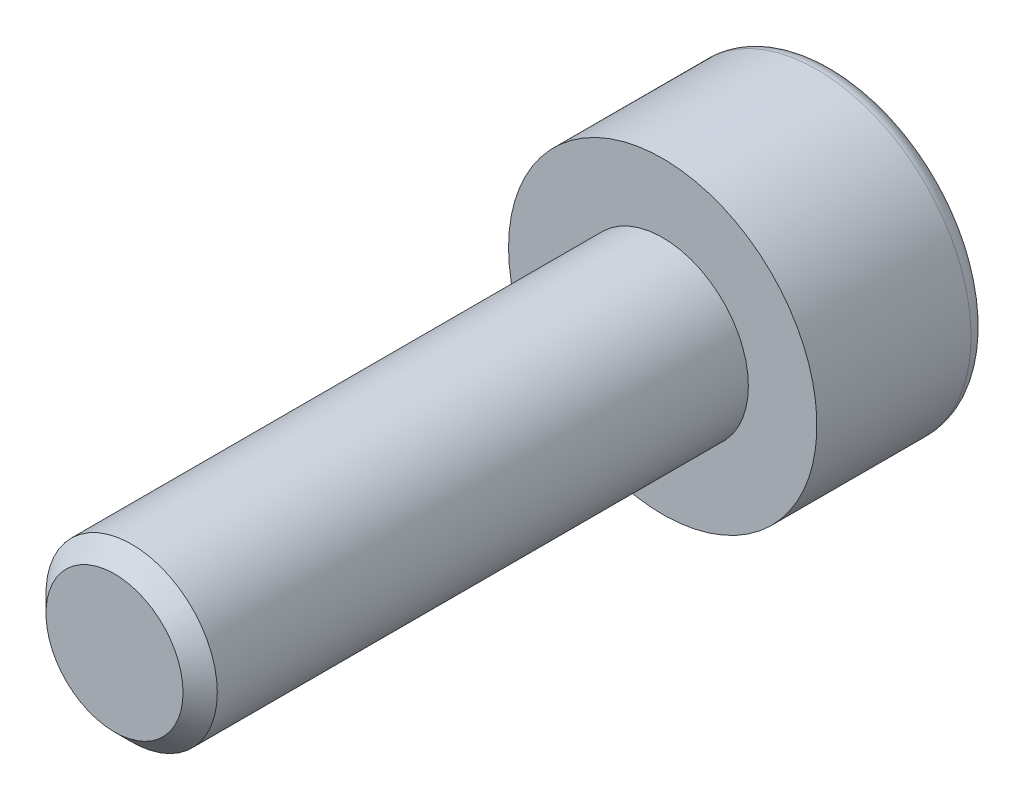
ISO-10303-21;
HEADER;
FILE_DESCRIPTION(('STEP AP214'),'2;1');
FILE_NAME('part.step','',(''),(''),'','','');
FILE_SCHEMA(('AUTOMOTIVE_DESIGN { 1 0 10303 214 1 1 1 1 }'));
ENDSEC;
DATA;
#1=APPLICATION_CONTEXT('core data for automotive mechanical design processes');
#2=APPLICATION_PROTOCOL_DEFINITION('international standard','automotive_design',2000,#1);
#3=PRODUCT_CONTEXT('',#1,'mechanical');
#4=PRODUCT('Part','Part','',(#3));
#5=PRODUCT_RELATED_PRODUCT_CATEGORY('part','',(#4));
#6=PRODUCT_DEFINITION_FORMATION('','',#4);
#7=PRODUCT_DEFINITION_CONTEXT('part definition',#1,'design');
#8=PRODUCT_DEFINITION('design','',#6,#7);
#9=PRODUCT_DEFINITION_SHAPE('','',#8);
#10=(LENGTH_UNIT() NAMED_UNIT(*) SI_UNIT(.MILLI.,.METRE.));
#11=(NAMED_UNIT(*) PLANE_ANGLE_UNIT() SI_UNIT($,.RADIAN.));
#12=(NAMED_UNIT(*) SI_UNIT($,.STERADIAN.) SOLID_ANGLE_UNIT());
#13=UNCERTAINTY_MEASURE_WITH_UNIT(LENGTH_MEASURE(1.E-05),#10,'distance_accuracy_value','');
#14=(GEOMETRIC_REPRESENTATION_CONTEXT(3) GLOBAL_UNCERTAINTY_ASSIGNED_CONTEXT((#13)) GLOBAL_UNIT_ASSIGNED_CONTEXT((#10,
#11,#12)) REPRESENTATION_CONTEXT('',''));
#15=CARTESIAN_POINT('',(0.,0.,0.));
#16=DIRECTION('',(0.,0.,1.));
#17=DIRECTION('',(1.,0.,0.));
#18=AXIS2_PLACEMENT_3D('',#15,#16,#17);
#19=CARTESIAN_POINT('',(0.,0.,-2.5));
#20=DIRECTION('',(0.,0.,1.));
#21=DIRECTION('',(1.,0.,0.));
#22=AXIS2_PLACEMENT_3D('',#19,#20,#21);
#23=PLANE('',#22);
#24=CARTESIAN_POINT('',(0.,0.,-2.5));
#25=DIRECTION('',(0.,0.,-1.));
#26=DIRECTION('',(-1.,0.,0.));
#27=AXIS2_PLACEMENT_3D('',#24,#25,#26);
#28=CIRCLE('',#27,2.);
#29=CARTESIAN_POINT('',(-2.,0.,-2.5));
#30=VERTEX_POINT('',#29);
#31=EDGE_CURVE('E138',#30,#30,#28,.T.);
#32=ORIENTED_EDGE('',*,*,#31,.T.);
#33=EDGE_LOOP('',(#32));
#34=FACE_BOUND('',#33,.T.);
#35=DIRECTION('',(-0.5,-0.866025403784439,0.));
#36=VECTOR('',#35,1.);
#37=CARTESIAN_POINT('',(-0.577350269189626,1.,-2.5));
#38=LINE('',#37,#36);
#39=CARTESIAN_POINT('',(-0.577350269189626,1.,-2.5));
#40=VERTEX_POINT('',#39);
#41=CARTESIAN_POINT('',(-1.15470053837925,0.,-2.5));
#42=VERTEX_POINT('',#41);
#43=EDGE_CURVE('E42',#40,#42,#38,.T.);
#44=ORIENTED_EDGE('',*,*,#43,.T.);
#45=DIRECTION('',(0.5,-0.866025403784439,0.));
#46=VECTOR('',#45,1.);
#47=CARTESIAN_POINT('',(-1.15470053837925,0.,-2.5));
#48=LINE('',#47,#46);
#49=CARTESIAN_POINT('',(-0.577350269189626,-0.999999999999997,-2.5));
#50=VERTEX_POINT('',#49);
#51=EDGE_CURVE('E82',#42,#50,#48,.T.);
#52=ORIENTED_EDGE('',*,*,#51,.T.);
#53=DIRECTION('',(1.,0.,0.));
#54=VECTOR('',#53,1.);
#55=CARTESIAN_POINT('',(-0.577350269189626,-0.999999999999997,-2.5));
#56=LINE('',#55,#54);
#57=CARTESIAN_POINT('',(0.577350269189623,-0.999999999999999,-2.5));
#58=VERTEX_POINT('',#57);
#59=EDGE_CURVE('E90',#50,#58,#56,.T.);
#60=ORIENTED_EDGE('',*,*,#59,.T.);
#61=DIRECTION('',(0.5,0.866025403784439,0.));
#62=VECTOR('',#61,1.);
#63=CARTESIAN_POINT('',(0.577350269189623,-0.999999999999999,-2.5));
#64=LINE('',#63,#62);
#65=CARTESIAN_POINT('',(1.15470053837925,0.,-2.5));
#66=VERTEX_POINT('',#65);
#67=EDGE_CURVE('E108',#58,#66,#64,.T.);
#68=ORIENTED_EDGE('',*,*,#67,.T.);
#69=DIRECTION('',(-0.5,0.866025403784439,0.));
#70=VECTOR('',#69,1.);
#71=CARTESIAN_POINT('',(1.15470053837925,0.,-2.5));
#72=LINE('',#71,#70);
#73=CARTESIAN_POINT('',(0.577350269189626,1.,-2.5));
#74=VERTEX_POINT('',#73);
#75=EDGE_CURVE('E111',#66,#74,#72,.T.);
#76=ORIENTED_EDGE('',*,*,#75,.T.);
#77=DIRECTION('',(-1.,0.,0.));
#78=VECTOR('',#77,1.);
#79=CARTESIAN_POINT('',(0.577350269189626,1.,-2.5));
#80=LINE('',#79,#78);
#81=EDGE_CURVE('E101',#74,#40,#80,.T.);
#82=ORIENTED_EDGE('',*,*,#81,.T.);
#83=EDGE_LOOP('',(#44,#52,#60,#68,#76,#82));
#84=FACE_BOUND('',#83,.T.);
#85=ADVANCED_FACE('F28',(#34,#84),#23,.F.);
#86=CARTESIAN_POINT('',(0.,0.,-2.25));
#87=DIRECTION('',(0.,0.,-1.));
#88=DIRECTION('',(-1.,0.,0.));
#89=AXIS2_PLACEMENT_3D('',#86,#87,#88);
#90=TOROIDAL_SURFACE('',#89,2.,0.25);
#91=ORIENTED_EDGE('',*,*,#31,.F.);
#92=EDGE_LOOP('',(#91));
#93=FACE_BOUND('',#92,.T.);
#94=CARTESIAN_POINT('',(0.,0.,-2.25));
#95=DIRECTION('',(0.,0.,-1.));
#96=DIRECTION('',(-1.,0.,0.));
#97=AXIS2_PLACEMENT_3D('',#94,#95,#96);
#98=CIRCLE('',#97,2.25);
#99=CARTESIAN_POINT('',(-2.25,0.,-2.25));
#100=VERTEX_POINT('',#99);
#101=EDGE_CURVE('E135',#100,#100,#98,.T.);
#102=ORIENTED_EDGE('',*,*,#101,.T.);
#103=EDGE_LOOP('',(#102));
#104=FACE_BOUND('',#103,.T.);
#105=ADVANCED_FACE('F157',(#93,#104),#90,.T.);
#106=CARTESIAN_POINT('',(0.,0.,0.));
#107=DIRECTION('',(0.,0.,-1.));
#108=DIRECTION('',(-1.,0.,0.));
#109=AXIS2_PLACEMENT_3D('',#106,#107,#108);
#110=CYLINDRICAL_SURFACE('',#109,2.25);
#111=ORIENTED_EDGE('',*,*,#101,.F.);
#112=EDGE_LOOP('',(#111));
#113=FACE_BOUND('',#112,.T.);
#114=CARTESIAN_POINT('',(0.,0.,0.));
#115=DIRECTION('',(0.,0.,-1.));
#116=DIRECTION('',(-1.,0.,0.));
#117=AXIS2_PLACEMENT_3D('',#114,#115,#116);
#118=CIRCLE('',#117,2.25);
#119=CARTESIAN_POINT('',(-2.25,0.,0.));
#120=VERTEX_POINT('',#119);
#121=EDGE_CURVE('E96',#120,#120,#118,.T.);
#122=ORIENTED_EDGE('',*,*,#121,.T.);
#123=EDGE_LOOP('',(#122));
#124=FACE_BOUND('',#123,.T.);
#125=ADVANCED_FACE('F162',(#113,#124),#110,.T.);
#126=CARTESIAN_POINT('',(0.,0.,0.));
#127=DIRECTION('',(0.,0.,-1.));
#128=DIRECTION('',(-1.,0.,0.));
#129=AXIS2_PLACEMENT_3D('',#126,#127,#128);
#130=PLANE('',#129);
#131=CARTESIAN_POINT('',(0.,0.,0.));
#132=DIRECTION('',(0.,0.,1.));
#133=DIRECTION('',(1.,0.,0.));
#134=AXIS2_PLACEMENT_3D('',#131,#132,#133);
#135=CIRCLE('',#134,1.25);
#136=CARTESIAN_POINT('',(1.25,0.,0.));
#137=VERTEX_POINT('',#136);
#138=EDGE_CURVE('E102',#137,#137,#135,.T.);
#139=ORIENTED_EDGE('',*,*,#138,.F.);
#140=EDGE_LOOP('',(#139));
#141=FACE_BOUND('',#140,.T.);
#142=ORIENTED_EDGE('',*,*,#121,.F.);
#143=EDGE_LOOP('',(#142));
#144=FACE_BOUND('',#143,.T.);
#145=ADVANCED_FACE('F170',(#141,#144),#130,.F.);
#146=CARTESIAN_POINT('',(-0.577350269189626,1.,-1.40000000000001));
#147=DIRECTION('',(0.866025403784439,-0.5,0.));
#148=DIRECTION('',(0.5,0.866025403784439,0.));
#149=AXIS2_PLACEMENT_3D('',#146,#147,#148);
#150=PLANE('',#149);
#151=ORIENTED_EDGE('',*,*,#43,.F.);
#152=DIRECTION('',(0.,0.,-1.));
#153=VECTOR('',#152,1.);
#154=CARTESIAN_POINT('',(-0.577350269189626,1.,-1.40000000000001));
#155=LINE('',#154,#153);
#156=CARTESIAN_POINT('',(-0.577350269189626,1.,-1.40000000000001));
#157=VERTEX_POINT('',#156);
#158=EDGE_CURVE('E124',#157,#40,#155,.T.);
#159=ORIENTED_EDGE('',*,*,#158,.F.);
#160=DIRECTION('',(-0.5,-0.866025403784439,0.));
#161=VECTOR('',#160,1.);
#162=CARTESIAN_POINT('',(-0.577350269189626,1.,-1.40000000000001));
#163=LINE('',#162,#161);
#164=CARTESIAN_POINT('',(-1.15470053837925,0.,-1.40000000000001));
#165=VERTEX_POINT('',#164);
#166=EDGE_CURVE('E95',#157,#165,#163,.T.);
#167=ORIENTED_EDGE('',*,*,#166,.T.);
#168=DIRECTION('',(0.,0.,-1.));
#169=VECTOR('',#168,1.);
#170=CARTESIAN_POINT('',(-1.15470053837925,0.,-1.40000000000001));
#171=LINE('',#170,#169);
#172=EDGE_CURVE('E84',#165,#42,#171,.T.);
#173=ORIENTED_EDGE('',*,*,#172,.T.);
#174=EDGE_LOOP('',(#151,#159,#167,#173));
#175=FACE_BOUND('',#174,.T.);
#176=ADVANCED_FACE('F93',(#175),#150,.T.);
#177=CARTESIAN_POINT('',(-1.15470053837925,0.,-1.40000000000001));
#178=DIRECTION('',(0.866025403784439,0.5,0.));
#179=DIRECTION('',(-0.5,0.866025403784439,0.));
#180=AXIS2_PLACEMENT_3D('',#177,#178,#179);
#181=PLANE('',#180);
#182=ORIENTED_EDGE('',*,*,#51,.F.);
#183=ORIENTED_EDGE('',*,*,#172,.F.);
#184=DIRECTION('',(0.5,-0.866025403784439,0.));
#185=VECTOR('',#184,1.);
#186=CARTESIAN_POINT('',(-1.15470053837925,0.,-1.40000000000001));
#187=LINE('',#186,#185);
#188=CARTESIAN_POINT('',(-0.577350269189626,-0.999999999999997,-1.40000000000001));
#189=VERTEX_POINT('',#188);
#190=EDGE_CURVE('E115',#165,#189,#187,.T.);
#191=ORIENTED_EDGE('',*,*,#190,.T.);
#192=DIRECTION('',(0.,0.,-1.));
#193=VECTOR('',#192,1.);
#194=CARTESIAN_POINT('',(-0.577350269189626,-0.999999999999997,-1.40000000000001));
#195=LINE('',#194,#193);
#196=EDGE_CURVE('E86',#189,#50,#195,.T.);
#197=ORIENTED_EDGE('',*,*,#196,.T.);
#198=EDGE_LOOP('',(#182,#183,#191,#197));
#199=FACE_BOUND('',#198,.T.);
#200=ADVANCED_FACE('F83',(#199),#181,.T.);
#201=CARTESIAN_POINT('',(-0.577350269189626,-0.999999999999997,-1.40000000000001));
#202=DIRECTION('',(0.,1.,0.));
#203=DIRECTION('',(-1.,0.,0.));
#204=AXIS2_PLACEMENT_3D('',#201,#202,#203);
#205=PLANE('',#204);
#206=ORIENTED_EDGE('',*,*,#59,.F.);
#207=ORIENTED_EDGE('',*,*,#196,.F.);
#208=DIRECTION('',(1.,0.,0.));
#209=VECTOR('',#208,1.);
#210=CARTESIAN_POINT('',(-0.577350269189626,-0.999999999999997,-1.40000000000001));
#211=LINE('',#210,#209);
#212=CARTESIAN_POINT('',(0.577350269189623,-0.999999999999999,-1.40000000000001));
#213=VERTEX_POINT('',#212);
#214=EDGE_CURVE('E117',#189,#213,#211,.T.);
#215=ORIENTED_EDGE('',*,*,#214,.T.);
#216=DIRECTION('',(0.,0.,-1.));
#217=VECTOR('',#216,1.);
#218=CARTESIAN_POINT('',(0.577350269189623,-0.999999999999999,-1.40000000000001));
#219=LINE('',#218,#217);
#220=EDGE_CURVE('E130',#213,#58,#219,.T.);
#221=ORIENTED_EDGE('',*,*,#220,.T.);
#222=EDGE_LOOP('',(#206,#207,#215,#221));
#223=FACE_BOUND('',#222,.T.);
#224=ADVANCED_FACE('F185',(#223),#205,.T.);
#225=CARTESIAN_POINT('',(0.577350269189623,-0.999999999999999,-1.40000000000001));
#226=DIRECTION('',(-0.866025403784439,0.5,0.));
#227=DIRECTION('',(-0.5,-0.866025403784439,0.));
#228=AXIS2_PLACEMENT_3D('',#225,#226,#227);
#229=PLANE('',#228);
#230=ORIENTED_EDGE('',*,*,#67,.F.);
#231=ORIENTED_EDGE('',*,*,#220,.F.);
#232=DIRECTION('',(0.5,0.866025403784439,0.));
#233=VECTOR('',#232,1.);
#234=CARTESIAN_POINT('',(0.577350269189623,-0.999999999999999,-1.40000000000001));
#235=LINE('',#234,#233);
#236=CARTESIAN_POINT('',(1.15470053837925,0.,-1.40000000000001));
#237=VERTEX_POINT('',#236);
#238=EDGE_CURVE('E119',#213,#237,#235,.T.);
#239=ORIENTED_EDGE('',*,*,#238,.T.);
#240=DIRECTION('',(0.,0.,-1.));
#241=VECTOR('',#240,1.);
#242=CARTESIAN_POINT('',(1.15470053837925,0.,-1.40000000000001));
#243=LINE('',#242,#241);
#244=EDGE_CURVE('E128',#237,#66,#243,.T.);
#245=ORIENTED_EDGE('',*,*,#244,.T.);
#246=EDGE_LOOP('',(#230,#231,#239,#245));
#247=FACE_BOUND('',#246,.T.);
#248=ADVANCED_FACE('F188',(#247),#229,.T.);
#249=CARTESIAN_POINT('',(1.15470053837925,0.,-1.40000000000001));
#250=DIRECTION('',(-0.866025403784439,-0.5,0.));
#251=DIRECTION('',(0.5,-0.866025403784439,0.));
#252=AXIS2_PLACEMENT_3D('',#249,#250,#251);
#253=PLANE('',#252);
#254=ORIENTED_EDGE('',*,*,#75,.F.);
#255=ORIENTED_EDGE('',*,*,#244,.F.);
#256=DIRECTION('',(-0.5,0.866025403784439,0.));
#257=VECTOR('',#256,1.);
#258=CARTESIAN_POINT('',(1.15470053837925,0.,-1.40000000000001));
#259=LINE('',#258,#257);
#260=CARTESIAN_POINT('',(0.577350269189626,1.,-1.40000000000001));
#261=VERTEX_POINT('',#260);
#262=EDGE_CURVE('E121',#237,#261,#259,.T.);
#263=ORIENTED_EDGE('',*,*,#262,.T.);
#264=DIRECTION('',(0.,0.,-1.));
#265=VECTOR('',#264,1.);
#266=CARTESIAN_POINT('',(0.577350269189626,1.,-1.40000000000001));
#267=LINE('',#266,#265);
#268=EDGE_CURVE('E126',#261,#74,#267,.T.);
#269=ORIENTED_EDGE('',*,*,#268,.T.);
#270=EDGE_LOOP('',(#254,#255,#263,#269));
#271=FACE_BOUND('',#270,.T.);
#272=ADVANCED_FACE('F192',(#271),#253,.T.);
#273=CARTESIAN_POINT('',(0.577350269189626,1.,-1.40000000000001));
#274=DIRECTION('',(0.,-1.,0.));
#275=DIRECTION('',(0.,0.,-1.));
#276=AXIS2_PLACEMENT_3D('',#273,#274,#275);
#277=PLANE('',#276);
#278=ORIENTED_EDGE('',*,*,#81,.F.);
#279=ORIENTED_EDGE('',*,*,#268,.F.);
#280=DIRECTION('',(-1.,0.,0.));
#281=VECTOR('',#280,1.);
#282=CARTESIAN_POINT('',(0.577350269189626,1.,-1.40000000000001));
#283=LINE('',#282,#281);
#284=EDGE_CURVE('E49',#261,#157,#283,.T.);
#285=ORIENTED_EDGE('',*,*,#284,.T.);
#286=ORIENTED_EDGE('',*,*,#158,.T.);
#287=EDGE_LOOP('',(#278,#279,#285,#286));
#288=FACE_BOUND('',#287,.T.);
#289=ADVANCED_FACE('F196',(#288),#277,.T.);
#290=CARTESIAN_POINT('',(-0.577350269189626,1.,-1.40000000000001));
#291=DIRECTION('',(0.,0.,-1.));
#292=DIRECTION('',(-1.,0.,0.));
#293=AXIS2_PLACEMENT_3D('',#290,#291,#292);
#294=PLANE('',#293);
#295=ORIENTED_EDGE('',*,*,#166,.F.);
#296=ORIENTED_EDGE('',*,*,#284,.F.);
#297=ORIENTED_EDGE('',*,*,#262,.F.);
#298=ORIENTED_EDGE('',*,*,#238,.F.);
#299=ORIENTED_EDGE('',*,*,#214,.F.);
#300=ORIENTED_EDGE('',*,*,#190,.F.);
#301=EDGE_LOOP('',(#295,#296,#297,#298,#299,#300));
#302=FACE_BOUND('',#301,.T.);
#303=ADVANCED_FACE('F200',(#302),#294,.T.);
#304=CARTESIAN_POINT('',(0.,0.,8.00000000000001));
#305=DIRECTION('',(0.,0.,1.));
#306=DIRECTION('',(1.,0.,0.));
#307=AXIS2_PLACEMENT_3D('',#304,#305,#306);
#308=PLANE('',#307);
#309=CARTESIAN_POINT('',(0.,0.,8.00000000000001));
#310=DIRECTION('',(0.,0.,1.));
#311=DIRECTION('',(1.,0.,0.));
#312=AXIS2_PLACEMENT_3D('',#309,#310,#311);
#313=CIRCLE('',#312,1.);
#314=CARTESIAN_POINT('',(1.,0.,8.00000000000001));
#315=VERTEX_POINT('',#314);
#316=EDGE_CURVE('E35',#315,#315,#313,.T.);
#317=ORIENTED_EDGE('',*,*,#316,.T.);
#318=EDGE_LOOP('',(#317));
#319=FACE_BOUND('',#318,.T.);
#320=ADVANCED_FACE('F143',(#319),#308,.T.);
#321=CARTESIAN_POINT('',(0.,0.,0.));
#322=DIRECTION('',(0.,0.,1.));
#323=DIRECTION('',(1.,0.,0.));
#324=AXIS2_PLACEMENT_3D('',#321,#322,#323);
#325=CYLINDRICAL_SURFACE('',#324,1.25);
#326=CARTESIAN_POINT('',(0.,0.,7.75000000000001));
#327=DIRECTION('',(0.,0.,1.));
#328=DIRECTION('',(1.,0.,0.));
#329=AXIS2_PLACEMENT_3D('',#326,#327,#328);
#330=CIRCLE('',#329,1.25);
#331=CARTESIAN_POINT('',(1.25,0.,7.75000000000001));
#332=VERTEX_POINT('',#331);
#333=EDGE_CURVE('E11',#332,#332,#330,.F.);
#334=ORIENTED_EDGE('',*,*,#333,.T.);
#335=EDGE_LOOP('',(#334));
#336=FACE_BOUND('',#335,.T.);
#337=ORIENTED_EDGE('',*,*,#138,.T.);
#338=EDGE_LOOP('',(#337));
#339=FACE_BOUND('',#338,.T.);
#340=ADVANCED_FACE('F147',(#336,#339),#325,.T.);
#341=CARTESIAN_POINT('',(0.,0.,8.00000000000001));
#342=DIRECTION('',(0.,0.,-1.));
#343=DIRECTION('',(-1.,0.,0.));
#344=AXIS2_PLACEMENT_3D('',#341,#342,#343);
#345=CONICAL_SURFACE('',#344,1.,0.785398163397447);
#346=ORIENTED_EDGE('',*,*,#333,.F.);
#347=EDGE_LOOP('',(#346));
#348=FACE_BOUND('',#347,.T.);
#349=ORIENTED_EDGE('',*,*,#316,.F.);
#350=EDGE_LOOP('',(#349));
#351=FACE_BOUND('',#350,.T.);
#352=ADVANCED_FACE('F145',(#348,#351),#345,.T.);
#353=CLOSED_SHELL('',(#85,#105,#125,#145,#176,#200,#224,#248,#272,#289,#303,#320,#340,#352));
#354=MANIFOLD_SOLID_BREP('B2',#353);
#355=ADVANCED_BREP_SHAPE_REPRESENTATION('',(#18,#354),#14);
#356=SHAPE_DEFINITION_REPRESENTATION(#9,#355);
ENDSEC;
END-ISO-10303-21;
